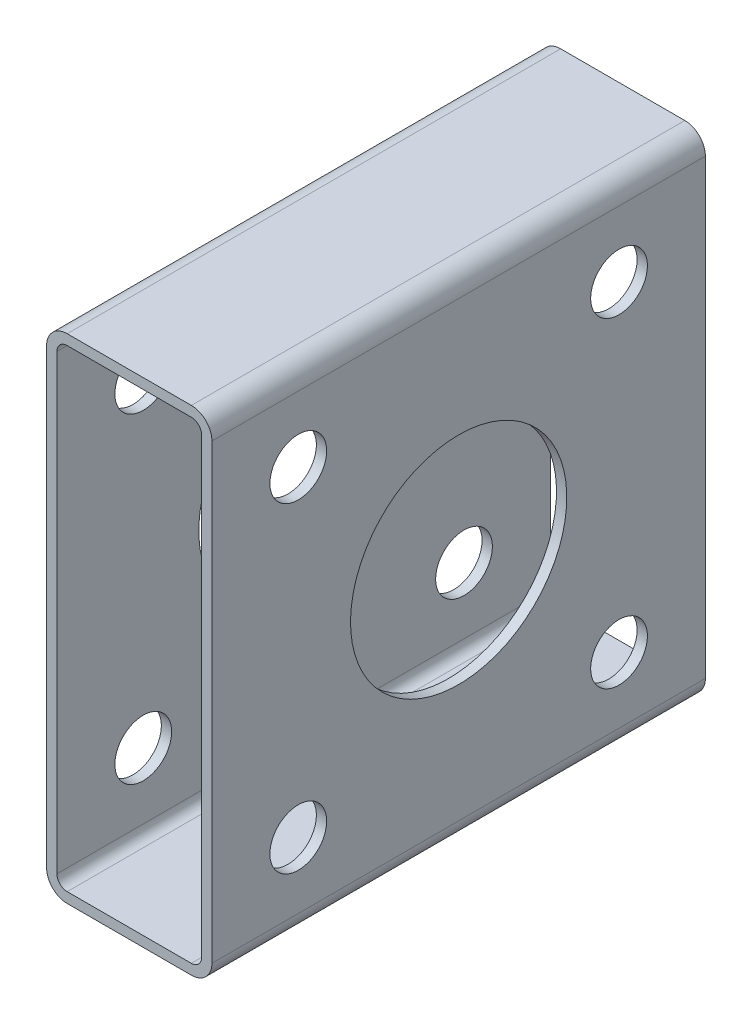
from build123d import *

# Parameters (mm, degrees)
CHANNEL_DEPTH              = 152.4
F_1_1_375_4_69_HOLES_REACH = 179.873
SKETCH2_R                  = 33.395304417
SKETCH2_R_2                = 8.763
F_1_2_55_4_69_HOLES_REACH  = 179.873
SKETCH4_R                  = 32.385
SKETCH4_R_2                = 8.763


with BuildPart() as part:
    # Sketch1 → CHANNEL (new body)
    with BuildSketch(Plane.XY):
        with BuildLine():
            Line((-31.75, -76.2), (6.604, -76.2))
            ThreePointArc((6.604, -76.2), (11.094128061, -74.340128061), (12.954, -69.85))
            Line((12.954, -69.85), (12.954, 69.85))
            ThreePointArc((12.954, 69.85), (11.094128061, 74.340128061), (6.604, 76.2))
            Line((6.604, 76.2), (-31.75, 76.2))
            ThreePointArc((-31.75, 76.2), (-36.240128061, 74.340128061), (-38.1, 69.85))
            Line((-38.1, 69.85), (-38.1, -69.85))
            ThreePointArc((-38.1, -69.85), (-36.240128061, -74.340128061), (-31.75, -76.2))
        make_face()
        with BuildLine():
            Line((-34.925, -69.85), (-34.925, 69.85))
            ThreePointArc((-34.925, 69.85), (-33.99506403, 72.09506403), (-31.75, 73.025))
            Line((-31.75, 73.025), (6.604, 73.025))
            ThreePointArc((6.604, 73.025), (8.84906403, 72.09506403), (9.779, 69.85))
            Line((9.779, 69.85), (9.779, -69.85))
            ThreePointArc((9.779, -69.85), (8.84906403, -72.09506403), (6.604, -73.025))
            Line((6.604, -73.025), (-31.75, -73.025))
            ThreePointArc((-31.75, -73.025), (-33.99506403, -72.09506403), (-34.925, -69.85))
        make_face(mode=Mode.SUBTRACT)
    extrude(amount=CHANNEL_DEPTH)

    # Sketch2 → 1_ 1.375 _4_ .69 HOLES (cut, up to next)
    with BuildSketch(Plane(origin=(12.954, 0, 0), x_dir=(0, 0, -1), z_dir=(1, 0, 0)), mode=Mode.PRIVATE) as f_1_1_375_4_69_holes_sk1:
        with Locations(Location((-76.2, 0, 0), (0, 0, 90))):
            Circle(SKETCH2_R)
    f_1_1_375_4_69_holes_tool1 = extrude(f_1_1_375_4_69_holes_sk1.sketch, amount=-F_1_1_375_4_69_HOLES_REACH, mode=Mode.PRIVATE) & part.part
    # Sketch2 → 1_ 1.375 _4_ .69 HOLES (cut, up to next)
    with BuildSketch(Plane(origin=(12.954, 0, 0), x_dir=(0, 0, -1), z_dir=(1, 0, 0)), mode=Mode.PRIVATE) as f_1_1_375_4_69_holes_sk2:
        with Locations(Location((-125.73, 49.53, 0), (0, 0, 90))):
            Circle(SKETCH2_R_2)
    f_1_1_375_4_69_holes_tool2 = extrude(f_1_1_375_4_69_holes_sk2.sketch, amount=-F_1_1_375_4_69_HOLES_REACH, mode=Mode.PRIVATE) & part.part
    # Sketch2 → 1_ 1.375 _4_ .69 HOLES (cut, up to next)
    with BuildSketch(Plane(origin=(12.954, 0, 0), x_dir=(0, 0, -1), z_dir=(1, 0, 0)), mode=Mode.PRIVATE) as f_1_1_375_4_69_holes_sk3:
        with Locations(Location((-26.67, 49.53, 0), (0, 0, 90))):
            Circle(SKETCH2_R_2)
    f_1_1_375_4_69_holes_tool3 = extrude(f_1_1_375_4_69_holes_sk3.sketch, amount=-F_1_1_375_4_69_HOLES_REACH, mode=Mode.PRIVATE) & part.part
    # Sketch2 → 1_ 1.375 _4_ .69 HOLES (cut, up to next)
    with BuildSketch(Plane(origin=(12.954, 0, 0), x_dir=(0, 0, -1), z_dir=(1, 0, 0)), mode=Mode.PRIVATE) as f_1_1_375_4_69_holes_sk4:
        with Locations(Location((-26.67, -49.53, 0), (0, 0, 90))):
            Circle(SKETCH2_R_2)
    f_1_1_375_4_69_holes_tool4 = extrude(f_1_1_375_4_69_holes_sk4.sketch, amount=-F_1_1_375_4_69_HOLES_REACH, mode=Mode.PRIVATE) & part.part
    # Sketch2 → 1_ 1.375 _4_ .69 HOLES (cut, up to next)
    with BuildSketch(Plane(origin=(12.954, 0, 0), x_dir=(0, 0, -1), z_dir=(1, 0, 0)), mode=Mode.PRIVATE) as f_1_1_375_4_69_holes_sk5:
        with Locations(Location((-125.73, -49.53, 0), (0, 0, 90))):
            Circle(SKETCH2_R_2)
    f_1_1_375_4_69_holes_tool5 = extrude(f_1_1_375_4_69_holes_sk5.sketch, amount=-F_1_1_375_4_69_HOLES_REACH, mode=Mode.PRIVATE) & part.part
    add(f_1_1_375_4_69_holes_tool1.solids().sort_by_distance((12.954, 0, 76.2))[0], mode=Mode.SUBTRACT)
    add(f_1_1_375_4_69_holes_tool2.solids().sort_by_distance((12.954, 49.53, 125.73))[0], mode=Mode.SUBTRACT)
    add(f_1_1_375_4_69_holes_tool3.solids().sort_by_distance((12.954, 49.53, 26.67))[0], mode=Mode.SUBTRACT)
    add(f_1_1_375_4_69_holes_tool4.solids().sort_by_distance((12.954, -49.53, 26.67))[0], mode=Mode.SUBTRACT)
    add(f_1_1_375_4_69_holes_tool5.solids().sort_by_distance((12.954, -49.53, 125.73))[0], mode=Mode.SUBTRACT)

    # Sketch4 → 1_ 2.55 _4_ .69 HOLES (cut, up to next)
    with BuildSketch(Plane.ZY.offset(38.1), mode=Mode.PRIVATE) as f_1_2_55_4_69_holes_sk1:
        with Locations(Location((76.2, 0, 0), (0, 0, 270))):
            Circle(SKETCH4_R)
    f_1_2_55_4_69_holes_tool1 = extrude(f_1_2_55_4_69_holes_sk1.sketch, amount=-F_1_2_55_4_69_HOLES_REACH, mode=Mode.PRIVATE) & part.part
    # Sketch4 → 1_ 2.55 _4_ .69 HOLES (cut, up to next)
    with BuildSketch(Plane.ZY.offset(38.1), mode=Mode.PRIVATE) as f_1_2_55_4_69_holes_sk2:
        with Locations(Location((26.67, 49.53, 0), (0, 0, 90))):
            Circle(SKETCH4_R_2)
    f_1_2_55_4_69_holes_tool2 = extrude(f_1_2_55_4_69_holes_sk2.sketch, amount=-F_1_2_55_4_69_HOLES_REACH, mode=Mode.PRIVATE) & part.part
    # Sketch4 → 1_ 2.55 _4_ .69 HOLES (cut, up to next)
    with BuildSketch(Plane.ZY.offset(38.1), mode=Mode.PRIVATE) as f_1_2_55_4_69_holes_sk3:
        with Locations(Location((125.73, 49.53, 0), (0, 0, 90))):
            Circle(SKETCH4_R_2)
    f_1_2_55_4_69_holes_tool3 = extrude(f_1_2_55_4_69_holes_sk3.sketch, amount=-F_1_2_55_4_69_HOLES_REACH, mode=Mode.PRIVATE) & part.part
    # Sketch4 → 1_ 2.55 _4_ .69 HOLES (cut, up to next)
    with BuildSketch(Plane.ZY.offset(38.1), mode=Mode.PRIVATE) as f_1_2_55_4_69_holes_sk4:
        with Locations(Location((26.67, -49.53, 0), (0, 0, 90))):
            Circle(SKETCH4_R_2)
    f_1_2_55_4_69_holes_tool4 = extrude(f_1_2_55_4_69_holes_sk4.sketch, amount=-F_1_2_55_4_69_HOLES_REACH, mode=Mode.PRIVATE) & part.part
    # Sketch4 → 1_ 2.55 _4_ .69 HOLES (cut, up to next)
    with BuildSketch(Plane.ZY.offset(38.1), mode=Mode.PRIVATE) as f_1_2_55_4_69_holes_sk5:
        with Locations(Location((125.73, -49.53, 0), (0, 0, 90))):
            Circle(SKETCH4_R_2)
    f_1_2_55_4_69_holes_tool5 = extrude(f_1_2_55_4_69_holes_sk5.sketch, amount=-F_1_2_55_4_69_HOLES_REACH, mode=Mode.PRIVATE) & part.part
    add(f_1_2_55_4_69_holes_tool1.solids().sort_by_distance((-38.1, 0, 76.2))[0], mode=Mode.SUBTRACT)
    add(f_1_2_55_4_69_holes_tool2.solids().sort_by_distance((-38.1, 49.53, 26.67))[0], mode=Mode.SUBTRACT)
    add(f_1_2_55_4_69_holes_tool3.solids().sort_by_distance((-38.1, 49.53, 125.73))[0], mode=Mode.SUBTRACT)
    add(f_1_2_55_4_69_holes_tool4.solids().sort_by_distance((-38.1, -49.53, 26.67))[0], mode=Mode.SUBTRACT)
    add(f_1_2_55_4_69_holes_tool5.solids().sort_by_distance((-38.1, -49.53, 125.73))[0], mode=Mode.SUBTRACT)


solid = part.part
